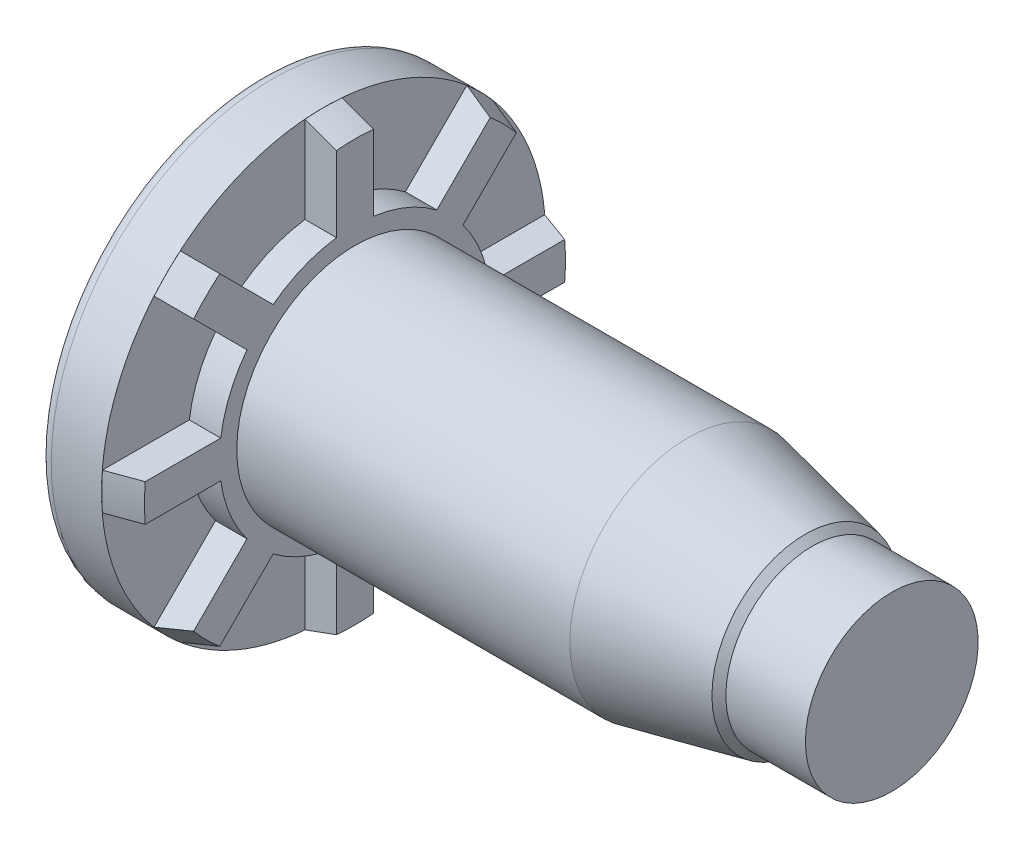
from build123d import *

# Parameters (mm, degrees)
RIBCUT_START     = -1.0541
RIBCUT_DEPTH     = 1.0541
RIBCUTSPAT_COUNT = 8
RIBCUTSPAT_ANGLE = 315


with BuildPart() as part:
    # BodySke → BaseBody (revolve)
    with BuildSketch(Plane.XY, mode=Mode.PRIVATE) as basebody_sk:
        with BuildLine():
            Line((-2.1082, 7.02056), (-2.1082, 0))
            Line((-2.1082, 0), (19.05, 0))
            Line((19.05, 0), (19.05, 2.8956))
            Line((19.05, 2.8956), (16.383, 2.8956))
            Line((16.383, 2.8956), (16.14932, 3.12928))
            Line((16.14932, 3.12928), (12.2174, 3.9624))
            Line((12.2174, 3.9624), (1.0541, 3.9624))
            Line((1.0541, 3.9624), (1.0541, 7.05692346))
            Line((1.0541, 7.05692346), (0.00254, 7.43966))
            Line((0.00254, 7.43966), (0, 7.43966))
            Line((0, 7.43966), (0, 7.4422))
            Line((0, 7.4422), (-1.68656, 7.4422))
            ThreePointArc((-1.68656, 7.4422), (-1.984704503, 7.318704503), (-2.1082, 7.02056))
        make_face()
    revolve(basebody_sk.sketch.rotate(Axis((0, 0, 0), (1, 0, 0)), 90), axis=Axis((0, 0, 0), (1, 0, 0)))

    # RibCutSke → RibCut (cut)
    with BuildSketch(Plane(origin=(1.0541, 1.794401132, -0.090952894), x_dir=(0, 0, -1), z_dir=(1, 0, 0)).offset(RIBCUT_START)):
        with BuildLine():
            Line((0.52890303, 2.705473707), (0.52890303, 5.621940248))
            ThreePointArc((0.52890303, 5.621940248), (2.757053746, 5.081295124), (4.71488806, 3.888048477))
            Line((4.71488806, 3.888048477), (2.652634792, 1.825795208))
            ThreePointArc((2.652634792, 1.825795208), (1.647335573, 2.40219846), (0.52890303, 2.705473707))
        make_face()
    ribcut = extrude(amount=RIBCUT_DEPTH, mode=Mode.SUBTRACT)

    # RibCutsPat: RibCut ×8 about axis
    ribcutspat_axis = Axis((0, 0, 0), (1, 0, 0))
    for i in range(1, RIBCUTSPAT_COUNT):
        add(ribcut.rotate(ribcutspat_axis, i * RIBCUTSPAT_ANGLE / (RIBCUTSPAT_COUNT - 1)), mode=Mode.SUBTRACT)


solid = part.part
